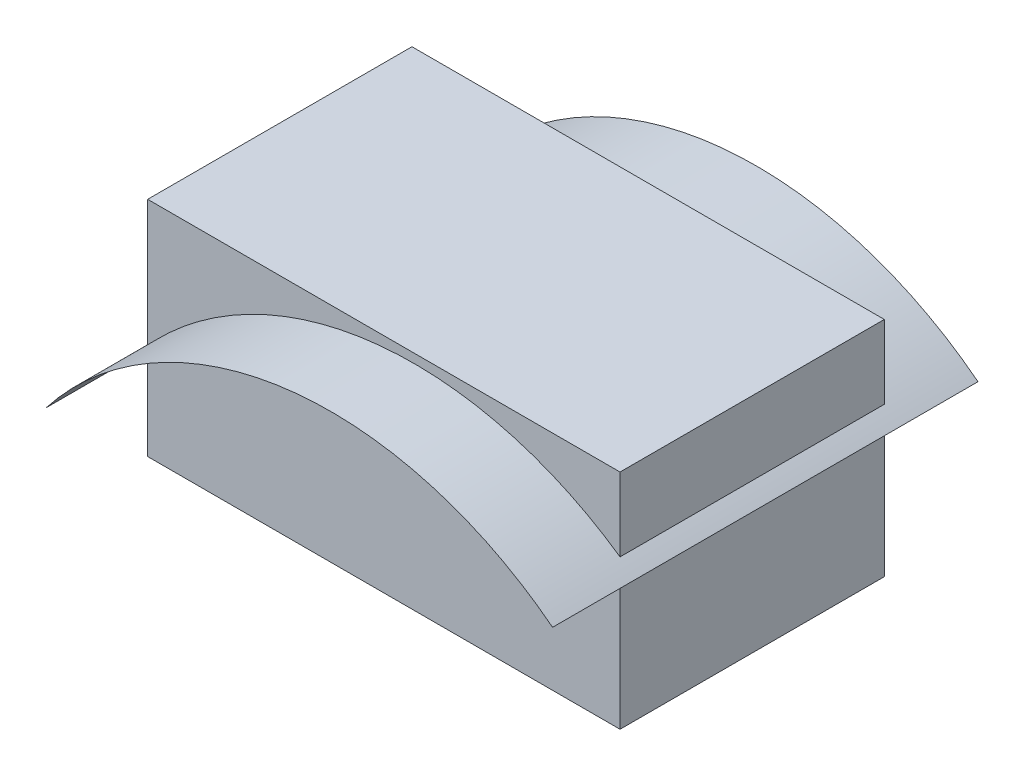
ISO-10303-21;
HEADER;
FILE_DESCRIPTION(('STEP AP214'),'2;1');
FILE_NAME('part.step','',(''),(''),'','','');
FILE_SCHEMA(('AUTOMOTIVE_DESIGN { 1 0 10303 214 1 1 1 1 }'));
ENDSEC;
DATA;
#1=APPLICATION_CONTEXT('core data for automotive mechanical design processes');
#2=APPLICATION_PROTOCOL_DEFINITION('international standard','automotive_design',2000,#1);
#3=PRODUCT_CONTEXT('',#1,'mechanical');
#4=PRODUCT('Part','Part','',(#3));
#5=PRODUCT_RELATED_PRODUCT_CATEGORY('part','',(#4));
#6=PRODUCT_DEFINITION_FORMATION('','',#4);
#7=PRODUCT_DEFINITION_CONTEXT('part definition',#1,'design');
#8=PRODUCT_DEFINITION('design','',#6,#7);
#9=PRODUCT_DEFINITION_SHAPE('','',#8);
#10=(LENGTH_UNIT() NAMED_UNIT(*) SI_UNIT(.MILLI.,.METRE.));
#11=(NAMED_UNIT(*) PLANE_ANGLE_UNIT() SI_UNIT($,.RADIAN.));
#12=(NAMED_UNIT(*) SI_UNIT($,.STERADIAN.) SOLID_ANGLE_UNIT());
#13=UNCERTAINTY_MEASURE_WITH_UNIT(LENGTH_MEASURE(1.E-05),#10,'distance_accuracy_value','');
#14=(GEOMETRIC_REPRESENTATION_CONTEXT(3) GLOBAL_UNCERTAINTY_ASSIGNED_CONTEXT((#13)) GLOBAL_UNIT_ASSIGNED_CONTEXT((#10,
#11,#12)) REPRESENTATION_CONTEXT('',''));
#15=CARTESIAN_POINT('',(0.,0.,0.));
#16=DIRECTION('',(0.,0.,1.));
#17=DIRECTION('',(1.,0.,0.));
#18=AXIS2_PLACEMENT_3D('',#15,#16,#17);
#19=CARTESIAN_POINT('',(61.4882748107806,-33.9655098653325,30.5));
#20=DIRECTION('',(0.,0.,1.));
#21=DIRECTION('',(1.,0.,0.));
#22=AXIS2_PLACEMENT_3D('',#19,#20,#21);
#23=CYLINDRICAL_SURFACE('',#22,83.321857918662);
#24=CARTESIAN_POINT('',(61.4882748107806,-33.9655098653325,49.696864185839));
#25=DIRECTION('',(0.,0.,-1.));
#26=DIRECTION('',(-1.,0.,0.));
#27=AXIS2_PLACEMENT_3D('',#24,#25,#26);
#28=CIRCLE('',#27,83.321857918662);
#29=CARTESIAN_POINT('',(-4.27328508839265,17.2003893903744,49.696864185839));
#30=VERTEX_POINT('',#29);
#31=CARTESIAN_POINT('',(112.654174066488,31.7960500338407,49.696864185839));
#32=VERTEX_POINT('',#31);
#33=EDGE_CURVE('E55',#30,#32,#28,.T.);
#34=ORIENTED_EDGE('',*,*,#33,.F.);
#35=DIRECTION('',(0.,0.,1.));
#36=VECTOR('',#35,1.);
#37=CARTESIAN_POINT('',(-4.27328508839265,17.2003893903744,30.5));
#38=LINE('',#37,#36);
#39=CARTESIAN_POINT('',(-4.27328508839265,17.2003893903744,-48.5));
#40=VERTEX_POINT('',#39);
#41=EDGE_CURVE('E47',#40,#30,#38,.T.);
#42=ORIENTED_EDGE('',*,*,#41,.F.);
#43=CARTESIAN_POINT('',(61.4882748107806,-33.9655098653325,-48.5));
#44=DIRECTION('',(0.,0.,-1.));
#45=DIRECTION('',(-1.,0.,0.));
#46=AXIS2_PLACEMENT_3D('',#43,#44,#45);
#47=CIRCLE('',#46,83.321857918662);
#48=CARTESIAN_POINT('',(112.654174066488,31.7960500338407,-48.5));
#49=VERTEX_POINT('',#48);
#50=EDGE_CURVE('E65',#40,#49,#47,.T.);
#51=ORIENTED_EDGE('',*,*,#50,.T.);
#52=DIRECTION('',(0.,0.,1.));
#53=VECTOR('',#52,1.);
#54=CARTESIAN_POINT('',(112.654174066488,31.7960500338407,30.5));
#55=LINE('',#54,#53);
#56=EDGE_CURVE('E12',#49,#32,#55,.T.);
#57=ORIENTED_EDGE('',*,*,#56,.T.);
#58=EDGE_LOOP('',(#34,#42,#51,#57));
#59=FACE_BOUND('',#58,.T.);
#60=ADVANCED_FACE('F46',(#59),#23,.F.);
#61=OPEN_SHELL('',(#60));
#62=SHELL_BASED_SURFACE_MODEL('B2',(#61));
#63=CARTESIAN_POINT('',(0.,0.,30.5));
#64=DIRECTION('',(1.,0.,0.));
#65=DIRECTION('',(0.,0.,-1.));
#66=AXIS2_PLACEMENT_3D('',#63,#64,#65);
#67=PLANE('',#66);
#68=DIRECTION('',(0.,-1.,0.));
#69=VECTOR('',#68,1.);
#70=CARTESIAN_POINT('',(0.,0.,-30.5));
#71=LINE('',#70,#69);
#72=CARTESIAN_POINT('',(0.,51.4290495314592,-30.5));
#73=VERTEX_POINT('',#72);
#74=CARTESIAN_POINT('',(0.,0.,-30.5));
#75=VERTEX_POINT('',#74);
#76=EDGE_CURVE('E152',#73,#75,#71,.T.);
#77=ORIENTED_EDGE('',*,*,#76,.T.);
#78=DIRECTION('',(0.,0.,-1.));
#79=VECTOR('',#78,1.);
#80=CARTESIAN_POINT('',(0.,0.,30.5));
#81=LINE('',#80,#79);
#82=CARTESIAN_POINT('',(0.,0.,30.5));
#83=VERTEX_POINT('',#82);
#84=EDGE_CURVE('E44',#83,#75,#81,.T.);
#85=ORIENTED_EDGE('',*,*,#84,.F.);
#86=DIRECTION('',(0.,-1.,0.));
#87=VECTOR('',#86,1.);
#88=CARTESIAN_POINT('',(0.,0.,30.5));
#89=LINE('',#88,#87);
#90=CARTESIAN_POINT('',(0.,51.4290495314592,30.5));
#91=VERTEX_POINT('',#90);
#92=EDGE_CURVE('E140',#91,#83,#89,.T.);
#93=ORIENTED_EDGE('',*,*,#92,.F.);
#94=DIRECTION('',(0.,0.,-1.));
#95=VECTOR('',#94,1.);
#96=CARTESIAN_POINT('',(0.,51.4290495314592,30.5));
#97=LINE('',#96,#95);
#98=EDGE_CURVE('E148',#91,#73,#97,.T.);
#99=ORIENTED_EDGE('',*,*,#98,.T.);
#100=EDGE_LOOP('',(#77,#85,#93,#99));
#101=FACE_BOUND('',#100,.T.);
#102=ADVANCED_FACE('F89',(#101),#67,.F.);
#103=CARTESIAN_POINT('',(0.,0.,30.5));
#104=DIRECTION('',(0.,1.,0.));
#105=DIRECTION('',(0.,0.,1.));
#106=AXIS2_PLACEMENT_3D('',#103,#104,#105);
#107=PLANE('',#106);
#108=DIRECTION('',(1.,0.,0.));
#109=VECTOR('',#108,1.);
#110=CARTESIAN_POINT('',(0.,0.,-30.5));
#111=LINE('',#110,#109);
#112=CARTESIAN_POINT('',(109.029585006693,0.,-30.5));
#113=VERTEX_POINT('',#112);
#114=EDGE_CURVE('E144',#75,#113,#111,.T.);
#115=ORIENTED_EDGE('',*,*,#114,.T.);
#116=DIRECTION('',(0.,0.,-1.));
#117=VECTOR('',#116,1.);
#118=CARTESIAN_POINT('',(109.029585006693,0.,30.5));
#119=LINE('',#118,#117);
#120=CARTESIAN_POINT('',(109.029585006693,0.,30.5));
#121=VERTEX_POINT('',#120);
#122=EDGE_CURVE('E97',#121,#113,#119,.T.);
#123=ORIENTED_EDGE('',*,*,#122,.F.);
#124=DIRECTION('',(1.,0.,0.));
#125=VECTOR('',#124,1.);
#126=CARTESIAN_POINT('',(0.,0.,30.5));
#127=LINE('',#126,#125);
#128=EDGE_CURVE('E135',#83,#121,#127,.T.);
#129=ORIENTED_EDGE('',*,*,#128,.F.);
#130=ORIENTED_EDGE('',*,*,#84,.T.);
#131=EDGE_LOOP('',(#115,#123,#129,#130));
#132=FACE_BOUND('',#131,.T.);
#133=ADVANCED_FACE('F143',(#132),#107,.F.);
#134=CARTESIAN_POINT('',(109.029585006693,0.,30.5));
#135=DIRECTION('',(-1.,0.,0.));
#136=DIRECTION('',(0.,0.,1.));
#137=AXIS2_PLACEMENT_3D('',#134,#135,#136);
#138=PLANE('',#137);
#139=DIRECTION('',(0.,1.,0.));
#140=VECTOR('',#139,1.);
#141=CARTESIAN_POINT('',(109.029585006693,0.,-30.5));
#142=LINE('',#141,#140);
#143=CARTESIAN_POINT('',(109.029585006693,51.4290495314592,-30.5));
#144=VERTEX_POINT('',#143);
#145=EDGE_CURVE('E122',#113,#144,#142,.T.);
#146=ORIENTED_EDGE('',*,*,#145,.T.);
#147=DIRECTION('',(0.,0.,-1.));
#148=VECTOR('',#147,1.);
#149=CARTESIAN_POINT('',(109.029585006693,51.4290495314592,30.5));
#150=LINE('',#149,#148);
#151=CARTESIAN_POINT('',(109.029585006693,51.4290495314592,30.5));
#152=VERTEX_POINT('',#151);
#153=EDGE_CURVE('E145',#152,#144,#150,.T.);
#154=ORIENTED_EDGE('',*,*,#153,.F.);
#155=DIRECTION('',(0.,1.,0.));
#156=VECTOR('',#155,1.);
#157=CARTESIAN_POINT('',(109.029585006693,0.,30.5));
#158=LINE('',#157,#156);
#159=EDGE_CURVE('E138',#121,#152,#158,.T.);
#160=ORIENTED_EDGE('',*,*,#159,.F.);
#161=ORIENTED_EDGE('',*,*,#122,.T.);
#162=EDGE_LOOP('',(#146,#154,#160,#161));
#163=FACE_BOUND('',#162,.T.);
#164=ADVANCED_FACE('F146',(#163),#138,.F.);
#165=CARTESIAN_POINT('',(0.,51.4290495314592,30.5));
#166=DIRECTION('',(0.,-1.,0.));
#167=DIRECTION('',(0.,0.,-1.));
#168=AXIS2_PLACEMENT_3D('',#165,#166,#167);
#169=PLANE('',#168);
#170=DIRECTION('',(-1.,0.,0.));
#171=VECTOR('',#170,1.);
#172=CARTESIAN_POINT('',(0.,51.4290495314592,-30.5));
#173=LINE('',#172,#171);
#174=EDGE_CURVE('E128',#144,#73,#173,.T.);
#175=ORIENTED_EDGE('',*,*,#174,.T.);
#176=ORIENTED_EDGE('',*,*,#98,.F.);
#177=DIRECTION('',(-1.,0.,0.));
#178=VECTOR('',#177,1.);
#179=CARTESIAN_POINT('',(0.,51.4290495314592,30.5));
#180=LINE('',#179,#178);
#181=EDGE_CURVE('E105',#152,#91,#180,.T.);
#182=ORIENTED_EDGE('',*,*,#181,.F.);
#183=ORIENTED_EDGE('',*,*,#153,.T.);
#184=EDGE_LOOP('',(#175,#176,#182,#183));
#185=FACE_BOUND('',#184,.T.);
#186=ADVANCED_FACE('F159',(#185),#169,.F.);
#187=CARTESIAN_POINT('',(0.,51.4290495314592,30.5));
#188=DIRECTION('',(0.,0.,-1.));
#189=DIRECTION('',(-1.,0.,0.));
#190=AXIS2_PLACEMENT_3D('',#187,#188,#189);
#191=PLANE('',#190);
#192=ORIENTED_EDGE('',*,*,#92,.T.);
#193=ORIENTED_EDGE('',*,*,#128,.T.);
#194=ORIENTED_EDGE('',*,*,#159,.T.);
#195=ORIENTED_EDGE('',*,*,#181,.T.);
#196=EDGE_LOOP('',(#192,#193,#194,#195));
#197=FACE_BOUND('',#196,.T.);
#198=ADVANCED_FACE('F136',(#197),#191,.F.);
#199=CARTESIAN_POINT('',(0.,51.4290495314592,-30.5));
#200=DIRECTION('',(0.,0.,-1.));
#201=DIRECTION('',(-1.,0.,0.));
#202=AXIS2_PLACEMENT_3D('',#199,#200,#201);
#203=PLANE('',#202);
#204=ORIENTED_EDGE('',*,*,#76,.F.);
#205=ORIENTED_EDGE('',*,*,#174,.F.);
#206=ORIENTED_EDGE('',*,*,#145,.F.);
#207=ORIENTED_EDGE('',*,*,#114,.F.);
#208=EDGE_LOOP('',(#204,#205,#206,#207));
#209=FACE_BOUND('',#208,.T.);
#210=ADVANCED_FACE('F162',(#209),#203,.T.);
#211=CLOSED_SHELL('',(#102,#133,#164,#186,#198,#210));
#212=MANIFOLD_SOLID_BREP('B6',#211);
#213=ADVANCED_BREP_SHAPE_REPRESENTATION('',(#18,#212),#14);
#214=MANIFOLD_SURFACE_SHAPE_REPRESENTATION('',(#18,#62),#14);
#215=SHAPE_REPRESENTATION('',(#18),#14);
#216=SHAPE_DEFINITION_REPRESENTATION(#9,#215);
#217=SHAPE_REPRESENTATION_RELATIONSHIP('','',#215,#213);
#218=SHAPE_REPRESENTATION_RELATIONSHIP('','',#215,#214);
ENDSEC;
END-ISO-10303-21;
